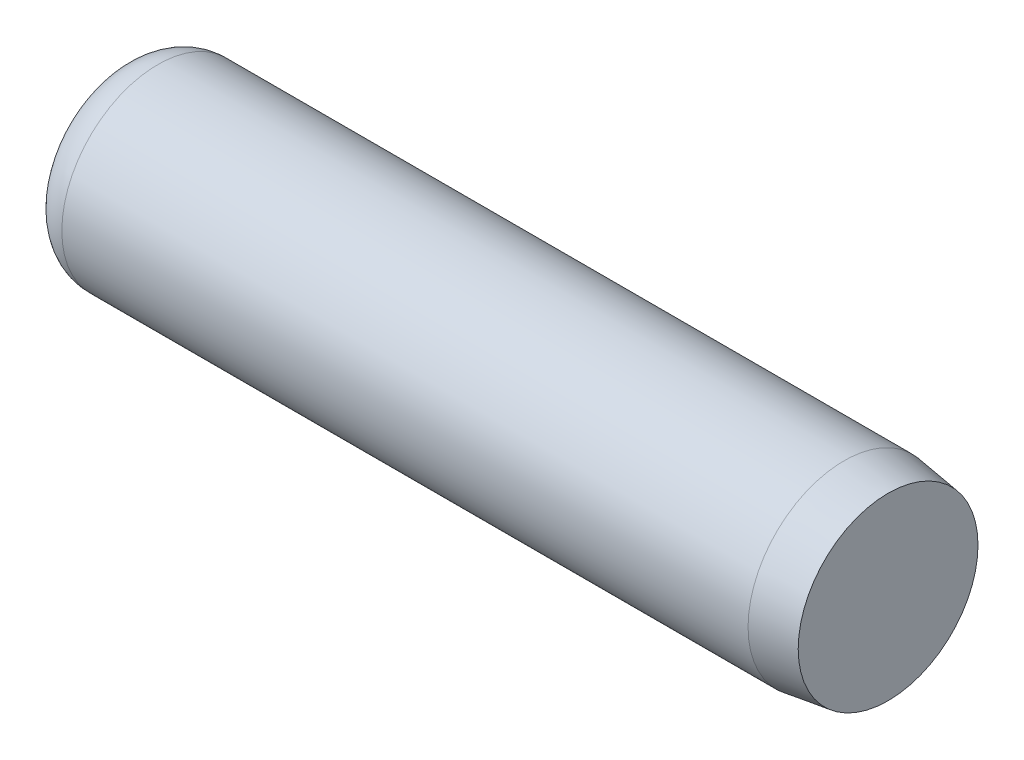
ISO-10303-21;
HEADER;
FILE_DESCRIPTION(('STEP AP214'),'2;1');
FILE_NAME('part.step','',(''),(''),'','','');
FILE_SCHEMA(('AUTOMOTIVE_DESIGN { 1 0 10303 214 1 1 1 1 }'));
ENDSEC;
DATA;
#1=APPLICATION_CONTEXT('core data for automotive mechanical design processes');
#2=APPLICATION_PROTOCOL_DEFINITION('international standard','automotive_design',2000,#1);
#3=PRODUCT_CONTEXT('',#1,'mechanical');
#4=PRODUCT('Part','Part','',(#3));
#5=PRODUCT_RELATED_PRODUCT_CATEGORY('part','',(#4));
#6=PRODUCT_DEFINITION_FORMATION('','',#4);
#7=PRODUCT_DEFINITION_CONTEXT('part definition',#1,'design');
#8=PRODUCT_DEFINITION('design','',#6,#7);
#9=PRODUCT_DEFINITION_SHAPE('','',#8);
#10=(LENGTH_UNIT() NAMED_UNIT(*) SI_UNIT(.MILLI.,.METRE.));
#11=(NAMED_UNIT(*) PLANE_ANGLE_UNIT() SI_UNIT($,.RADIAN.));
#12=(NAMED_UNIT(*) SI_UNIT($,.STERADIAN.) SOLID_ANGLE_UNIT());
#13=UNCERTAINTY_MEASURE_WITH_UNIT(LENGTH_MEASURE(1.E-05),#10,'distance_accuracy_value','');
#14=(GEOMETRIC_REPRESENTATION_CONTEXT(3) GLOBAL_UNCERTAINTY_ASSIGNED_CONTEXT((#13)) GLOBAL_UNIT_ASSIGNED_CONTEXT((#10,
#11,#12)) REPRESENTATION_CONTEXT('',''));
#15=CARTESIAN_POINT('',(0.,0.,0.));
#16=DIRECTION('',(0.,0.,1.));
#17=DIRECTION('',(1.,0.,0.));
#18=AXIS2_PLACEMENT_3D('',#15,#16,#17);
#19=CARTESIAN_POINT('',(0.,7.61999999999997,0.));
#20=DIRECTION('',(1.,0.,0.));
#21=DIRECTION('',(0.,0.,-1.));
#22=AXIS2_PLACEMENT_3D('',#19,#20,#21);
#23=PLANE('',#22);
#24=CARTESIAN_POINT('',(0.,0.,0.));
#25=DIRECTION('',(-1.,0.,0.));
#26=DIRECTION('',(0.,0.,1.));
#27=AXIS2_PLACEMENT_3D('',#24,#25,#26);
#28=CIRCLE('',#27,7.61999999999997);
#29=CARTESIAN_POINT('',(0.,0.,7.61999999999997));
#30=VERTEX_POINT('',#29);
#31=EDGE_CURVE('E44',#30,#30,#28,.T.);
#32=ORIENTED_EDGE('',*,*,#31,.T.);
#33=EDGE_LOOP('',(#32));
#34=FACE_BOUND('',#33,.T.);
#35=ADVANCED_FACE('F30',(#34),#23,.F.);
#36=CARTESIAN_POINT('',(101.6,0.,0.));
#37=DIRECTION('',(-1.,0.,0.));
#38=DIRECTION('',(0.,0.,1.));
#39=AXIS2_PLACEMENT_3D('',#36,#37,#38);
#40=PLANE('',#39);
#41=CARTESIAN_POINT('',(101.6,0.,0.));
#42=DIRECTION('',(-1.,0.,0.));
#43=DIRECTION('',(0.,0.,1.));
#44=AXIS2_PLACEMENT_3D('',#41,#42,#43);
#45=CIRCLE('',#44,11.883290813);
#46=CARTESIAN_POINT('',(101.6,0.,11.883290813));
#47=VERTEX_POINT('',#46);
#48=EDGE_CURVE('E10',#47,#47,#45,.T.);
#49=ORIENTED_EDGE('',*,*,#48,.F.);
#50=EDGE_LOOP('',(#49));
#51=FACE_BOUND('',#50,.T.);
#52=ADVANCED_FACE('F64',(#51),#40,.F.);
#53=CARTESIAN_POINT('',(101.6,0.,0.));
#54=DIRECTION('',(-1.,0.,0.));
#55=DIRECTION('',(0.,0.,1.));
#56=AXIS2_PLACEMENT_3D('',#53,#54,#55);
#57=CONICAL_SURFACE('',#56,11.883290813,0.139626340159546);
#58=CARTESIAN_POINT('',(95.7888121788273,0.,0.));
#59=DIRECTION('',(-1.,0.,0.));
#60=DIRECTION('',(0.,0.,1.));
#61=AXIS2_PLACEMENT_3D('',#58,#59,#60);
#62=CIRCLE('',#61,12.7);
#63=CARTESIAN_POINT('',(95.7888121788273,0.,12.7));
#64=VERTEX_POINT('',#63);
#65=EDGE_CURVE('E36',#64,#64,#62,.T.);
#66=ORIENTED_EDGE('',*,*,#65,.F.);
#67=EDGE_LOOP('',(#66));
#68=FACE_BOUND('',#67,.T.);
#69=ORIENTED_EDGE('',*,*,#48,.T.);
#70=EDGE_LOOP('',(#69));
#71=FACE_BOUND('',#70,.T.);
#72=ADVANCED_FACE('F59',(#68,#71),#57,.T.);
#73=CARTESIAN_POINT('',(-6.35,0.,0.));
#74=DIRECTION('',(-1.,0.,0.));
#75=DIRECTION('',(0.,0.,1.));
#76=AXIS2_PLACEMENT_3D('',#73,#74,#75);
#77=CYLINDRICAL_SURFACE('',#76,12.7);
#78=CARTESIAN_POINT('',(5.08,0.,0.));
#79=DIRECTION('',(-1.,0.,0.));
#80=DIRECTION('',(0.,0.,1.));
#81=AXIS2_PLACEMENT_3D('',#78,#79,#80);
#82=CIRCLE('',#81,12.7);
#83=CARTESIAN_POINT('',(5.08,0.,12.7));
#84=VERTEX_POINT('',#83);
#85=EDGE_CURVE('E40',#84,#84,#82,.T.);
#86=ORIENTED_EDGE('',*,*,#85,.F.);
#87=EDGE_LOOP('',(#86));
#88=FACE_BOUND('',#87,.T.);
#89=ORIENTED_EDGE('',*,*,#65,.T.);
#90=EDGE_LOOP('',(#89));
#91=FACE_BOUND('',#90,.T.);
#92=ADVANCED_FACE('F54',(#88,#91),#77,.T.);
#93=CARTESIAN_POINT('',(5.08,0.,0.));
#94=DIRECTION('',(-1.,0.,0.));
#95=DIRECTION('',(0.,0.,1.));
#96=AXIS2_PLACEMENT_3D('',#93,#94,#95);
#97=TOROIDAL_SURFACE('',#96,7.61999999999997,5.08);
#98=ORIENTED_EDGE('',*,*,#31,.F.);
#99=EDGE_LOOP('',(#98));
#100=FACE_BOUND('',#99,.T.);
#101=ORIENTED_EDGE('',*,*,#85,.T.);
#102=EDGE_LOOP('',(#101));
#103=FACE_BOUND('',#102,.T.);
#104=ADVANCED_FACE('F51',(#100,#103),#97,.T.);
#105=CLOSED_SHELL('',(#35,#52,#72,#92,#104));
#106=MANIFOLD_SOLID_BREP('B2',#105);
#107=ADVANCED_BREP_SHAPE_REPRESENTATION('',(#18,#106),#14);
#108=SHAPE_DEFINITION_REPRESENTATION(#9,#107);
ENDSEC;
END-ISO-10303-21;
